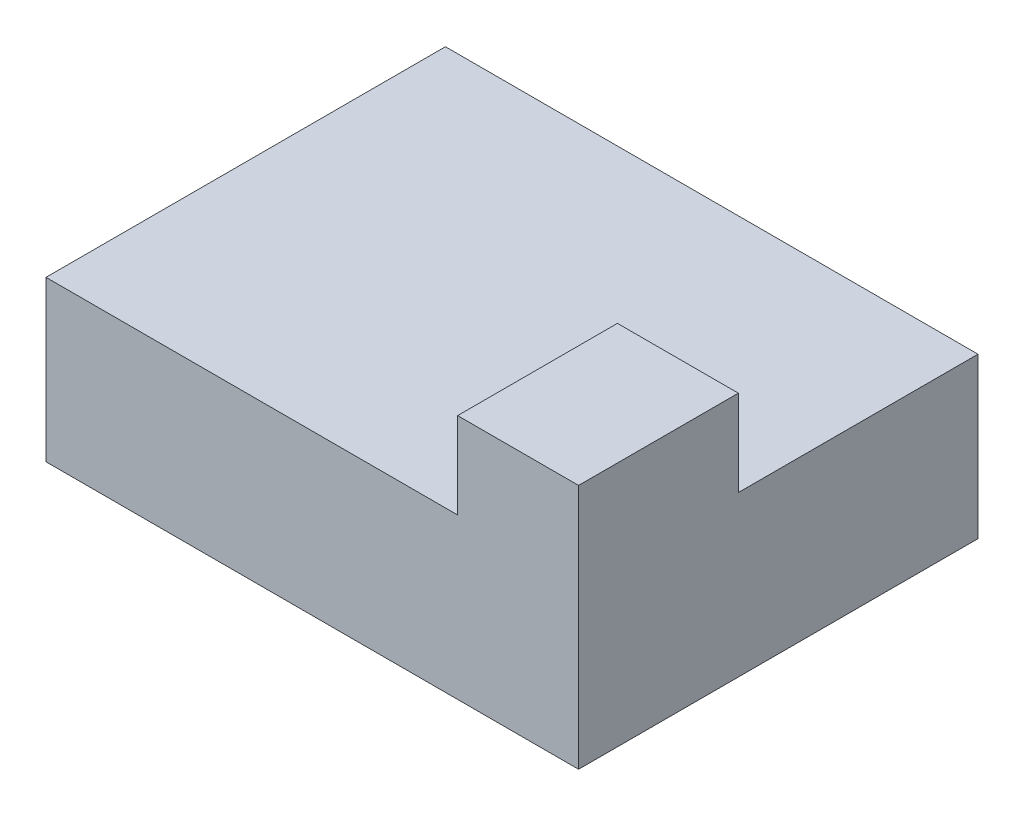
from build123d import *

# Parameters (mm, degrees)
SKETCH1_W      = 100
SKETCH1_H      = 75
EXTRUDE1_DEPTH = 30
SKETCH7_W      = 22.705637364
SKETCH7_H      = 16.161683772
EXTRUDE9_DEPTH = 30


with BuildPart() as part:
    # Sketch1 → Extrude1 (new body)
    with BuildSketch(Plane(origin=(0, 0, 0), x_dir=(1, 0, 0), z_dir=(0, 1, 0))):
        Rectangle(SKETCH1_W, SKETCH1_H)
    extrude(amount=EXTRUDE1_DEPTH)

    # Sketch7 → Extrude9 (add)
    with BuildSketch(Plane.XY.offset(37.5)):
        with Locations((38.647181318, 38.080841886)):
            Rectangle(SKETCH7_W, SKETCH7_H)
    extrude(amount=-EXTRUDE9_DEPTH)


solid = part.part
